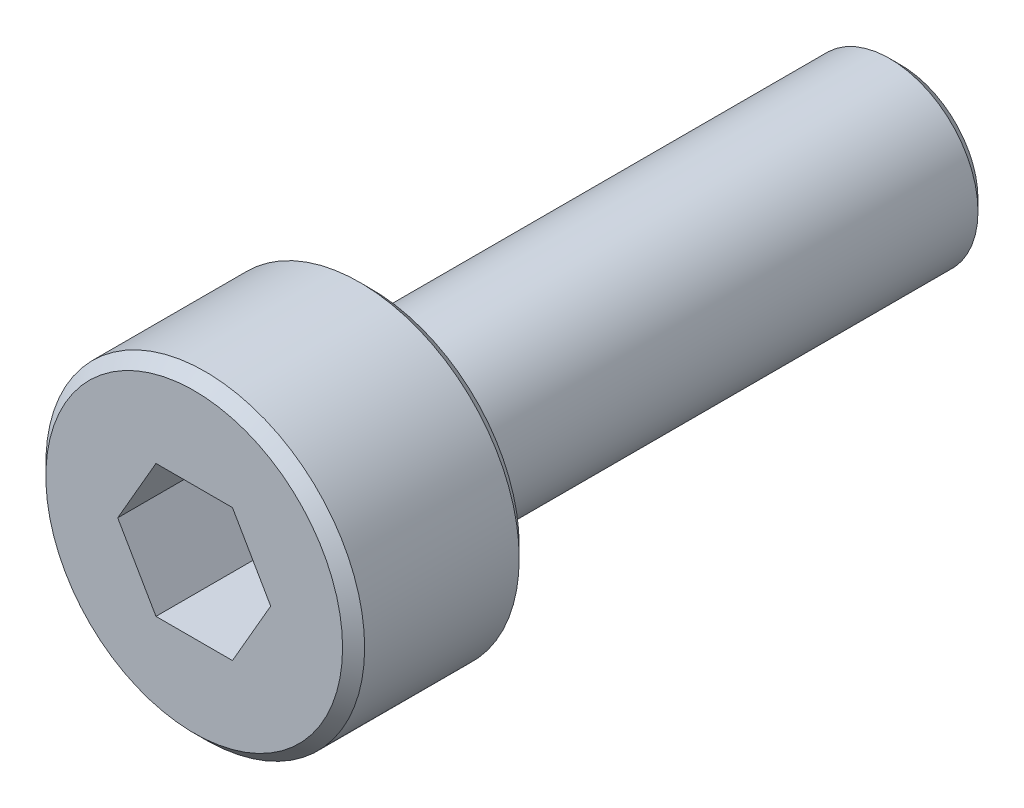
from build123d import *

# Parameters (mm, degrees)
SKETCH1_R           = 2
BOSS_EXTRUDE1_DEPTH = 12
SKETCH2_R           = 3.61
BOSS_EXTRUDE2_DEPTH = 4
CUT_EXTRUDE1_DEPTH  = 2.5
CHAMFER1_SIZE       = 0.25


with BuildPart() as part:
    # Sketch1 → Boss-Extrude1 (new body)
    with BuildSketch(Plane(origin=(0, 0, 0), x_dir=(0, 1, 0), z_dir=(0, 0, 1))):
        with Locations(Location((0, 0, 0), (0, 0, 270))):
            Circle(SKETCH1_R)
    extrude(amount=BOSS_EXTRUDE1_DEPTH)

    # Sketch2 → Boss-Extrude2 (add)
    with BuildSketch(Plane.XY.offset(12)):
        Circle(SKETCH2_R)
    extrude(amount=BOSS_EXTRUDE2_DEPTH)

    # Sketch3 → Cut-Extrude1 (cut)
    with BuildSketch(Plane.XY.offset(16)):
        Polygon((1.732050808, 0), (0.866025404, 1.5), (-0.866025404, 1.5), (-1.732050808, 0), (-0.866025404, -1.5), (0.866025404, -1.5), align=None)
    extrude(amount=-CUT_EXTRUDE1_DEPTH, mode=Mode.SUBTRACT)

    # Chamfer1
    chamfer1_edges = [part.edges().sort_by_distance(p)[0] for p in [
        (-2, 0, 0),
        (-3.61, 0, 12),
        (-3.61, 0, 16),
    ]]
    chamfer(chamfer1_edges, length=CHAMFER1_SIZE)


solid = part.part
